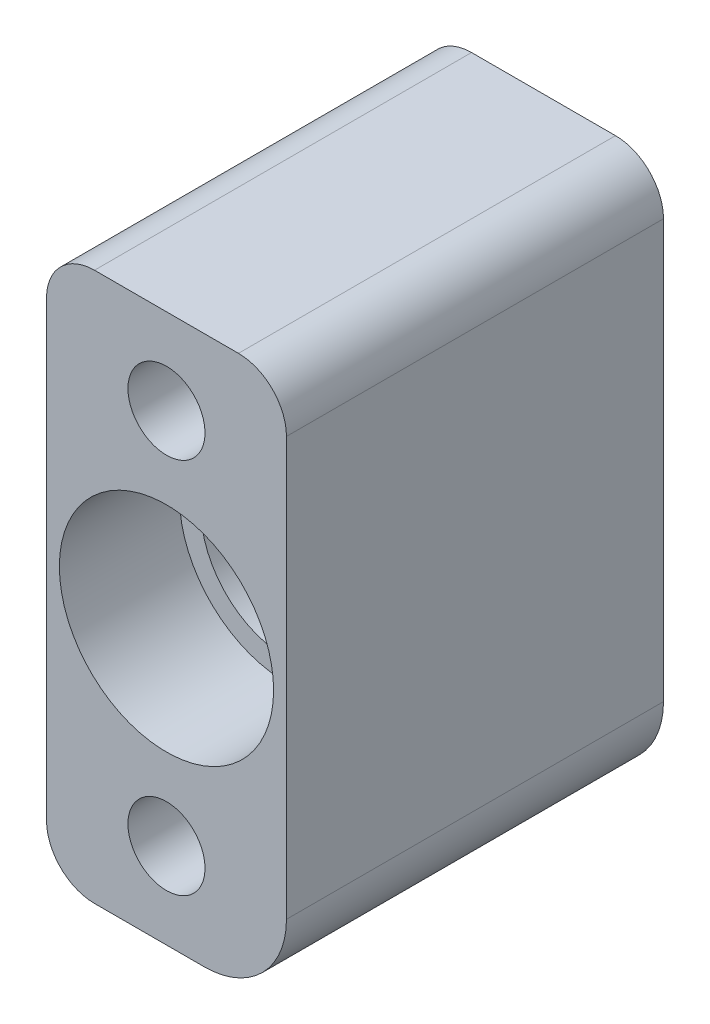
ISO-10303-21;
HEADER;
FILE_DESCRIPTION(('STEP AP214'),'2;1');
FILE_NAME('part.step','',(''),(''),'','','');
FILE_SCHEMA(('AUTOMOTIVE_DESIGN { 1 0 10303 214 1 1 1 1 }'));
ENDSEC;
DATA;
#1=APPLICATION_CONTEXT('core data for automotive mechanical design processes');
#2=APPLICATION_PROTOCOL_DEFINITION('international standard','automotive_design',2000,#1);
#3=PRODUCT_CONTEXT('',#1,'mechanical');
#4=PRODUCT('Part','Part','',(#3));
#5=PRODUCT_RELATED_PRODUCT_CATEGORY('part','',(#4));
#6=PRODUCT_DEFINITION_FORMATION('','',#4);
#7=PRODUCT_DEFINITION_CONTEXT('part definition',#1,'design');
#8=PRODUCT_DEFINITION('design','',#6,#7);
#9=PRODUCT_DEFINITION_SHAPE('','',#8);
#10=(LENGTH_UNIT() NAMED_UNIT(*) SI_UNIT(.MILLI.,.METRE.));
#11=(NAMED_UNIT(*) PLANE_ANGLE_UNIT() SI_UNIT($,.RADIAN.));
#12=(NAMED_UNIT(*) SI_UNIT($,.STERADIAN.) SOLID_ANGLE_UNIT());
#13=UNCERTAINTY_MEASURE_WITH_UNIT(LENGTH_MEASURE(1.E-05),#10,'distance_accuracy_value','');
#14=(GEOMETRIC_REPRESENTATION_CONTEXT(3) GLOBAL_UNCERTAINTY_ASSIGNED_CONTEXT((#13)) GLOBAL_UNIT_ASSIGNED_CONTEXT((#10,
#11,#12)) REPRESENTATION_CONTEXT('',''));
#15=CARTESIAN_POINT('',(0.,0.,0.));
#16=DIRECTION('',(0.,0.,1.));
#17=DIRECTION('',(1.,0.,0.));
#18=AXIS2_PLACEMENT_3D('',#15,#16,#17);
#19=CARTESIAN_POINT('',(-757.586295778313,-48.7304062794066,71.9582));
#20=DIRECTION('',(0.,0.,-1.));
#21=DIRECTION('',(-1.,0.,0.));
#22=AXIS2_PLACEMENT_3D('',#19,#20,#21);
#23=CYLINDRICAL_SURFACE('',#22,7.62000000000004);
#24=CARTESIAN_POINT('',(-757.586295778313,-48.7304062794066,37.0332));
#25=DIRECTION('',(0.,0.,-1.));
#26=DIRECTION('',(-1.,0.,0.));
#27=AXIS2_PLACEMENT_3D('',#24,#25,#26);
#28=CIRCLE('',#27,7.62000000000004);
#29=CARTESIAN_POINT('',(-749.966295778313,-48.7304062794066,37.0332));
#30=VERTEX_POINT('',#29);
#31=CARTESIAN_POINT('',(-757.586295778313,-56.3504062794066,37.0332));
#32=VERTEX_POINT('',#31);
#33=EDGE_CURVE('E101',#30,#32,#28,.T.);
#34=ORIENTED_EDGE('',*,*,#33,.F.);
#35=DIRECTION('',(0.,0.,-1.));
#36=VECTOR('',#35,1.);
#37=CARTESIAN_POINT('',(-749.966295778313,-48.7304062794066,71.9582));
#38=LINE('',#37,#36);
#39=CARTESIAN_POINT('',(-749.966295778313,-48.7304062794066,71.9582));
#40=VERTEX_POINT('',#39);
#41=EDGE_CURVE('E12',#40,#30,#38,.T.);
#42=ORIENTED_EDGE('',*,*,#41,.F.);
#43=CARTESIAN_POINT('',(-757.586295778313,-48.7304062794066,71.9582));
#44=DIRECTION('',(0.,0.,-1.));
#45=DIRECTION('',(-1.,0.,0.));
#46=AXIS2_PLACEMENT_3D('',#43,#44,#45);
#47=CIRCLE('',#46,7.62000000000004);
#48=CARTESIAN_POINT('',(-757.586295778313,-56.3504062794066,71.9582));
#49=VERTEX_POINT('',#48);
#50=EDGE_CURVE('E103',#40,#49,#47,.T.);
#51=ORIENTED_EDGE('',*,*,#50,.T.);
#52=DIRECTION('',(0.,0.,-1.));
#53=VECTOR('',#52,1.);
#54=CARTESIAN_POINT('',(-757.586295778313,-56.3504062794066,71.9582));
#55=LINE('',#54,#53);
#56=EDGE_CURVE('E99',#49,#32,#55,.T.);
#57=ORIENTED_EDGE('',*,*,#56,.T.);
#58=EDGE_LOOP('',(#34,#42,#51,#57));
#59=FACE_BOUND('',#58,.T.);
#60=ADVANCED_FACE('F48',(#59),#23,.T.);
#61=CARTESIAN_POINT('',(-749.966295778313,-9.99540627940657,71.9582));
#62=DIRECTION('',(1.,0.,0.));
#63=DIRECTION('',(0.,1.,0.));
#64=AXIS2_PLACEMENT_3D('',#61,#62,#63);
#65=PLANE('',#64);
#66=DIRECTION('',(0.,-1.,0.));
#67=VECTOR('',#66,1.);
#68=CARTESIAN_POINT('',(-749.966295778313,-48.7304062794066,37.0332));
#69=LINE('',#68,#67);
#70=CARTESIAN_POINT('',(-749.966295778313,-9.99540627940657,37.0332));
#71=VERTEX_POINT('',#70);
#72=EDGE_CURVE('E114',#71,#30,#69,.T.);
#73=ORIENTED_EDGE('',*,*,#72,.F.);
#74=DIRECTION('',(0.,0.,-1.));
#75=VECTOR('',#74,1.);
#76=CARTESIAN_POINT('',(-749.966295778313,-9.99540627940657,71.9582));
#77=LINE('',#76,#75);
#78=CARTESIAN_POINT('',(-749.966295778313,-9.99540627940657,71.9582));
#79=VERTEX_POINT('',#78);
#80=EDGE_CURVE('E58',#79,#71,#77,.T.);
#81=ORIENTED_EDGE('',*,*,#80,.F.);
#82=DIRECTION('',(0.,-1.,0.));
#83=VECTOR('',#82,1.);
#84=CARTESIAN_POINT('',(-749.966295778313,-9.99540627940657,71.9582));
#85=LINE('',#84,#83);
#86=EDGE_CURVE('E105',#79,#40,#85,.T.);
#87=ORIENTED_EDGE('',*,*,#86,.T.);
#88=ORIENTED_EDGE('',*,*,#41,.T.);
#89=EDGE_LOOP('',(#73,#81,#87,#88));
#90=FACE_BOUND('',#89,.T.);
#91=ADVANCED_FACE('F218',(#90),#65,.T.);
#92=CARTESIAN_POINT('',(-754.411295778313,-9.99540627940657,71.9582));
#93=DIRECTION('',(0.,0.,-1.));
#94=DIRECTION('',(-1.,0.,0.));
#95=AXIS2_PLACEMENT_3D('',#92,#93,#94);
#96=CYLINDRICAL_SURFACE('',#95,4.44500000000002);
#97=CARTESIAN_POINT('',(-754.411295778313,-9.99540627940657,37.0332));
#98=DIRECTION('',(0.,0.,-1.));
#99=DIRECTION('',(-1.,0.,0.));
#100=AXIS2_PLACEMENT_3D('',#97,#98,#99);
#101=CIRCLE('',#100,4.44500000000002);
#102=CARTESIAN_POINT('',(-754.411295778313,-5.55040627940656,37.0332));
#103=VERTEX_POINT('',#102);
#104=EDGE_CURVE('E125',#103,#71,#101,.T.);
#105=ORIENTED_EDGE('',*,*,#104,.F.);
#106=DIRECTION('',(0.,0.,-1.));
#107=VECTOR('',#106,1.);
#108=CARTESIAN_POINT('',(-754.411295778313,-5.55040627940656,71.9582));
#109=LINE('',#108,#107);
#110=CARTESIAN_POINT('',(-754.411295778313,-5.55040627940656,71.9582));
#111=VERTEX_POINT('',#110);
#112=EDGE_CURVE('E170',#111,#103,#109,.T.);
#113=ORIENTED_EDGE('',*,*,#112,.F.);
#114=CARTESIAN_POINT('',(-754.411295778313,-9.99540627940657,71.9582));
#115=DIRECTION('',(0.,0.,-1.));
#116=DIRECTION('',(-1.,0.,0.));
#117=AXIS2_PLACEMENT_3D('',#114,#115,#116);
#118=CIRCLE('',#117,4.44500000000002);
#119=EDGE_CURVE('E177',#111,#79,#118,.T.);
#120=ORIENTED_EDGE('',*,*,#119,.T.);
#121=ORIENTED_EDGE('',*,*,#80,.T.);
#122=EDGE_LOOP('',(#105,#113,#120,#121));
#123=FACE_BOUND('',#122,.T.);
#124=ADVANCED_FACE('F176',(#123),#96,.T.);
#125=CARTESIAN_POINT('',(-754.411295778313,-5.55040627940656,71.9582));
#126=DIRECTION('',(0.,1.,0.));
#127=DIRECTION('',(-1.,0.,0.));
#128=AXIS2_PLACEMENT_3D('',#125,#126,#127);
#129=PLANE('',#128);
#130=DIRECTION('',(1.,0.,0.));
#131=VECTOR('',#130,1.);
#132=CARTESIAN_POINT('',(-757.586295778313,-5.55040627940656,37.0332));
#133=LINE('',#132,#131);
#134=CARTESIAN_POINT('',(-767.746295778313,-5.55040627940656,37.0332));
#135=VERTEX_POINT('',#134);
#136=EDGE_CURVE('E127',#135,#103,#133,.T.);
#137=ORIENTED_EDGE('',*,*,#136,.F.);
#138=DIRECTION('',(0.,0.,-1.));
#139=VECTOR('',#138,1.);
#140=CARTESIAN_POINT('',(-767.746295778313,-5.55040627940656,71.9582));
#141=LINE('',#140,#139);
#142=CARTESIAN_POINT('',(-767.746295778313,-5.55040627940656,71.9582));
#143=VERTEX_POINT('',#142);
#144=EDGE_CURVE('E158',#143,#135,#141,.T.);
#145=ORIENTED_EDGE('',*,*,#144,.F.);
#146=DIRECTION('',(1.,0.,0.));
#147=VECTOR('',#146,1.);
#148=CARTESIAN_POINT('',(-754.411295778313,-5.55040627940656,71.9582));
#149=LINE('',#148,#147);
#150=EDGE_CURVE('E171',#143,#111,#149,.T.);
#151=ORIENTED_EDGE('',*,*,#150,.T.);
#152=ORIENTED_EDGE('',*,*,#112,.T.);
#153=EDGE_LOOP('',(#137,#145,#151,#152));
#154=FACE_BOUND('',#153,.T.);
#155=ADVANCED_FACE('F165',(#154),#129,.T.);
#156=CARTESIAN_POINT('',(-767.746295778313,-9.99540627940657,71.9582));
#157=DIRECTION('',(0.,0.,-1.));
#158=DIRECTION('',(-1.,0.,0.));
#159=AXIS2_PLACEMENT_3D('',#156,#157,#158);
#160=CYLINDRICAL_SURFACE('',#159,4.44500000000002);
#161=CARTESIAN_POINT('',(-767.746295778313,-9.99540627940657,37.0332));
#162=DIRECTION('',(0.,0.,-1.));
#163=DIRECTION('',(-1.,0.,0.));
#164=AXIS2_PLACEMENT_3D('',#161,#162,#163);
#165=CIRCLE('',#164,4.44500000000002);
#166=CARTESIAN_POINT('',(-772.191295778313,-9.99540627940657,37.0332));
#167=VERTEX_POINT('',#166);
#168=EDGE_CURVE('E130',#167,#135,#165,.T.);
#169=ORIENTED_EDGE('',*,*,#168,.F.);
#170=DIRECTION('',(0.,0.,-1.));
#171=VECTOR('',#170,1.);
#172=CARTESIAN_POINT('',(-772.191295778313,-9.99540627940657,71.9582));
#173=LINE('',#172,#171);
#174=CARTESIAN_POINT('',(-772.191295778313,-9.99540627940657,71.9582));
#175=VERTEX_POINT('',#174);
#176=EDGE_CURVE('E148',#175,#167,#173,.T.);
#177=ORIENTED_EDGE('',*,*,#176,.F.);
#178=CARTESIAN_POINT('',(-767.746295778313,-9.99540627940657,71.9582));
#179=DIRECTION('',(0.,0.,-1.));
#180=DIRECTION('',(1.,0.,0.));
#181=AXIS2_PLACEMENT_3D('',#178,#179,#180);
#182=CIRCLE('',#181,4.44500000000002);
#183=EDGE_CURVE('E215',#175,#143,#182,.T.);
#184=ORIENTED_EDGE('',*,*,#183,.T.);
#185=ORIENTED_EDGE('',*,*,#144,.T.);
#186=EDGE_LOOP('',(#169,#177,#184,#185));
#187=FACE_BOUND('',#186,.T.);
#188=ADVANCED_FACE('F160',(#187),#160,.T.);
#189=CARTESIAN_POINT('',(-772.191295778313,-9.99540627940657,71.9582));
#190=DIRECTION('',(-1.,0.,0.));
#191=DIRECTION('',(0.,0.,1.));
#192=AXIS2_PLACEMENT_3D('',#189,#190,#191);
#193=PLANE('',#192);
#194=DIRECTION('',(0.,1.,0.));
#195=VECTOR('',#194,1.);
#196=CARTESIAN_POINT('',(-772.191295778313,-48.7304062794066,37.0332));
#197=LINE('',#196,#195);
#198=CARTESIAN_POINT('',(-772.191295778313,-51.9054062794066,37.0332));
#199=VERTEX_POINT('',#198);
#200=EDGE_CURVE('E133',#199,#167,#197,.T.);
#201=ORIENTED_EDGE('',*,*,#200,.F.);
#202=DIRECTION('',(0.,0.,-1.));
#203=VECTOR('',#202,1.);
#204=CARTESIAN_POINT('',(-772.191295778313,-51.9054062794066,71.9582));
#205=LINE('',#204,#203);
#206=CARTESIAN_POINT('',(-772.191295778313,-51.9054062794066,71.9582));
#207=VERTEX_POINT('',#206);
#208=EDGE_CURVE('E142',#207,#199,#205,.T.);
#209=ORIENTED_EDGE('',*,*,#208,.F.);
#210=DIRECTION('',(0.,1.,0.));
#211=VECTOR('',#210,1.);
#212=CARTESIAN_POINT('',(-772.191295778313,-9.99540627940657,71.9582));
#213=LINE('',#212,#211);
#214=EDGE_CURVE('E154',#207,#175,#213,.T.);
#215=ORIENTED_EDGE('',*,*,#214,.T.);
#216=ORIENTED_EDGE('',*,*,#176,.T.);
#217=EDGE_LOOP('',(#201,#209,#215,#216));
#218=FACE_BOUND('',#217,.T.);
#219=ADVANCED_FACE('F150',(#218),#193,.T.);
#220=CARTESIAN_POINT('',(-767.746295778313,-51.9054062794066,71.9582));
#221=DIRECTION('',(0.,0.,-1.));
#222=DIRECTION('',(-1.,0.,0.));
#223=AXIS2_PLACEMENT_3D('',#220,#221,#222);
#224=CYLINDRICAL_SURFACE('',#223,4.44500000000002);
#225=CARTESIAN_POINT('',(-767.746295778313,-51.9054062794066,37.0332));
#226=DIRECTION('',(0.,0.,-1.));
#227=DIRECTION('',(-1.,0.,0.));
#228=AXIS2_PLACEMENT_3D('',#225,#226,#227);
#229=CIRCLE('',#228,4.44500000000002);
#230=CARTESIAN_POINT('',(-767.746295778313,-56.3504062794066,37.0332));
#231=VERTEX_POINT('',#230);
#232=EDGE_CURVE('E111',#231,#199,#229,.T.);
#233=ORIENTED_EDGE('',*,*,#232,.F.);
#234=DIRECTION('',(0.,0.,-1.));
#235=VECTOR('',#234,1.);
#236=CARTESIAN_POINT('',(-767.746295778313,-56.3504062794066,71.9582));
#237=LINE('',#236,#235);
#238=CARTESIAN_POINT('',(-767.746295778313,-56.3504062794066,71.9582));
#239=VERTEX_POINT('',#238);
#240=EDGE_CURVE('E95',#239,#231,#237,.T.);
#241=ORIENTED_EDGE('',*,*,#240,.F.);
#242=CARTESIAN_POINT('',(-767.746295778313,-51.9054062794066,71.9582));
#243=DIRECTION('',(0.,0.,-1.));
#244=DIRECTION('',(-1.,0.,0.));
#245=AXIS2_PLACEMENT_3D('',#242,#243,#244);
#246=CIRCLE('',#245,4.44500000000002);
#247=EDGE_CURVE('E144',#239,#207,#246,.T.);
#248=ORIENTED_EDGE('',*,*,#247,.T.);
#249=ORIENTED_EDGE('',*,*,#208,.T.);
#250=EDGE_LOOP('',(#233,#241,#248,#249));
#251=FACE_BOUND('',#250,.T.);
#252=ADVANCED_FACE('F137',(#251),#224,.T.);
#253=CARTESIAN_POINT('',(-757.586295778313,-56.3504062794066,71.9582));
#254=DIRECTION('',(0.,-1.,0.));
#255=DIRECTION('',(1.,0.,0.));
#256=AXIS2_PLACEMENT_3D('',#253,#254,#255);
#257=PLANE('',#256);
#258=DIRECTION('',(-1.,0.,0.));
#259=VECTOR('',#258,1.);
#260=CARTESIAN_POINT('',(-757.586295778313,-56.3504062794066,37.0332));
#261=LINE('',#260,#259);
#262=EDGE_CURVE('E52',#32,#231,#261,.T.);
#263=ORIENTED_EDGE('',*,*,#262,.F.);
#264=ORIENTED_EDGE('',*,*,#56,.F.);
#265=DIRECTION('',(-1.,0.,0.));
#266=VECTOR('',#265,1.);
#267=CARTESIAN_POINT('',(-757.586295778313,-56.3504062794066,71.9582));
#268=LINE('',#267,#266);
#269=EDGE_CURVE('E211',#49,#239,#268,.T.);
#270=ORIENTED_EDGE('',*,*,#269,.T.);
#271=ORIENTED_EDGE('',*,*,#240,.T.);
#272=EDGE_LOOP('',(#263,#264,#270,#271));
#273=FACE_BOUND('',#272,.T.);
#274=ADVANCED_FACE('F108',(#273),#257,.T.);
#275=CARTESIAN_POINT('',(-757.586295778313,-48.7304062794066,71.9582));
#276=DIRECTION('',(0.,0.,-1.));
#277=DIRECTION('',(-1.,0.,0.));
#278=AXIS2_PLACEMENT_3D('',#275,#276,#277);
#279=PLANE('',#278);
#280=CARTESIAN_POINT('',(-761.078795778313,-13.4879062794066,71.9582));
#281=DIRECTION('',(0.,0.,-1.));
#282=DIRECTION('',(-1.,0.,0.));
#283=AXIS2_PLACEMENT_3D('',#280,#281,#282);
#284=CIRCLE('',#283,3.56869999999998);
#285=CARTESIAN_POINT('',(-764.647495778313,-13.4879062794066,71.9582));
#286=VERTEX_POINT('',#285);
#287=EDGE_CURVE('E382',#286,#286,#284,.T.);
#288=ORIENTED_EDGE('',*,*,#287,.T.);
#289=EDGE_LOOP('',(#288));
#290=FACE_BOUND('',#289,.T.);
#291=CARTESIAN_POINT('',(-761.078795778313,-48.4129062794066,71.9582));
#292=DIRECTION('',(0.,0.,-1.));
#293=DIRECTION('',(-1.,0.,0.));
#294=AXIS2_PLACEMENT_3D('',#291,#292,#293);
#295=CIRCLE('',#294,3.56869999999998);
#296=CARTESIAN_POINT('',(-764.647495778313,-48.4129062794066,71.9582));
#297=VERTEX_POINT('',#296);
#298=EDGE_CURVE('E188',#297,#297,#295,.T.);
#299=ORIENTED_EDGE('',*,*,#298,.T.);
#300=EDGE_LOOP('',(#299));
#301=FACE_BOUND('',#300,.T.);
#302=CARTESIAN_POINT('',(-761.078795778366,-30.9504062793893,71.9582));
#303=DIRECTION('',(0.,0.,1.));
#304=DIRECTION('',(1.,0.,0.));
#305=AXIS2_PLACEMENT_3D('',#302,#303,#304);
#306=CIRCLE('',#305,9.92187499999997);
#307=CARTESIAN_POINT('',(-751.156920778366,-30.9504062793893,71.9582));
#308=VERTEX_POINT('',#307);
#309=EDGE_CURVE('E115',#308,#308,#306,.T.);
#310=ORIENTED_EDGE('',*,*,#309,.F.);
#311=EDGE_LOOP('',(#310));
#312=FACE_BOUND('',#311,.T.);
#313=ORIENTED_EDGE('',*,*,#50,.F.);
#314=ORIENTED_EDGE('',*,*,#86,.F.);
#315=ORIENTED_EDGE('',*,*,#119,.F.);
#316=ORIENTED_EDGE('',*,*,#150,.F.);
#317=ORIENTED_EDGE('',*,*,#183,.F.);
#318=ORIENTED_EDGE('',*,*,#214,.F.);
#319=ORIENTED_EDGE('',*,*,#247,.F.);
#320=ORIENTED_EDGE('',*,*,#269,.F.);
#321=EDGE_LOOP('',(#313,#314,#315,#316,#317,#318,#319,#320));
#322=FACE_BOUND('',#321,.T.);
#323=ADVANCED_FACE('F220',(#290,#301,#312,#322),#279,.F.);
#324=CARTESIAN_POINT('',(-757.586295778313,-48.7304062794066,37.0332));
#325=DIRECTION('',(0.,0.,-1.));
#326=DIRECTION('',(-1.,0.,0.));
#327=AXIS2_PLACEMENT_3D('',#324,#325,#326);
#328=PLANE('',#327);
#329=CARTESIAN_POINT('',(-761.078795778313,-13.4879062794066,37.0332));
#330=DIRECTION('',(0.,0.,-1.));
#331=DIRECTION('',(-1.,0.,0.));
#332=AXIS2_PLACEMENT_3D('',#329,#330,#331);
#333=CIRCLE('',#332,5.35940000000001);
#334=CARTESIAN_POINT('',(-766.438195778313,-13.4879062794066,37.0332));
#335=VERTEX_POINT('',#334);
#336=EDGE_CURVE('E186',#335,#335,#333,.T.);
#337=ORIENTED_EDGE('',*,*,#336,.F.);
#338=EDGE_LOOP('',(#337));
#339=FACE_BOUND('',#338,.T.);
#340=CARTESIAN_POINT('',(-761.078795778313,-48.4129062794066,37.0332));
#341=DIRECTION('',(0.,0.,-1.));
#342=DIRECTION('',(-1.,0.,0.));
#343=AXIS2_PLACEMENT_3D('',#340,#341,#342);
#344=CIRCLE('',#343,5.35940000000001);
#345=CARTESIAN_POINT('',(-766.438195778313,-48.4129062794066,37.0332));
#346=VERTEX_POINT('',#345);
#347=EDGE_CURVE('E190',#346,#346,#344,.T.);
#348=ORIENTED_EDGE('',*,*,#347,.F.);
#349=EDGE_LOOP('',(#348));
#350=FACE_BOUND('',#349,.T.);
#351=CARTESIAN_POINT('',(-761.078795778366,-30.9504062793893,37.0332));
#352=DIRECTION('',(0.,0.,-1.));
#353=DIRECTION('',(-1.,0.,0.));
#354=AXIS2_PLACEMENT_3D('',#351,#352,#353);
#355=CIRCLE('',#354,7.93750000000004);
#356=CARTESIAN_POINT('',(-769.016295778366,-30.9504062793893,37.0332));
#357=VERTEX_POINT('',#356);
#358=EDGE_CURVE('E122',#357,#357,#355,.F.);
#359=ORIENTED_EDGE('',*,*,#358,.T.);
#360=EDGE_LOOP('',(#359));
#361=FACE_BOUND('',#360,.T.);
#362=ORIENTED_EDGE('',*,*,#33,.T.);
#363=ORIENTED_EDGE('',*,*,#262,.T.);
#364=ORIENTED_EDGE('',*,*,#232,.T.);
#365=ORIENTED_EDGE('',*,*,#200,.T.);
#366=ORIENTED_EDGE('',*,*,#168,.T.);
#367=ORIENTED_EDGE('',*,*,#136,.T.);
#368=ORIENTED_EDGE('',*,*,#104,.T.);
#369=ORIENTED_EDGE('',*,*,#72,.T.);
#370=EDGE_LOOP('',(#362,#363,#364,#365,#366,#367,#368,#369));
#371=FACE_BOUND('',#370,.T.);
#372=ADVANCED_FACE('F50',(#339,#350,#361,#371),#328,.T.);
#373=CARTESIAN_POINT('',(-761.078795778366,-30.9504062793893,71.9582));
#374=DIRECTION('',(0.,0.,1.));
#375=DIRECTION('',(1.,0.,0.));
#376=AXIS2_PLACEMENT_3D('',#373,#374,#375);
#377=CYLINDRICAL_SURFACE('',#376,9.92187499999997);
#378=CARTESIAN_POINT('',(-761.078795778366,-30.9504062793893,60.833));
#379=DIRECTION('',(0.,0.,1.));
#380=DIRECTION('',(1.,0.,0.));
#381=AXIS2_PLACEMENT_3D('',#378,#379,#380);
#382=CIRCLE('',#381,9.92187499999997);
#383=CARTESIAN_POINT('',(-751.156920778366,-30.9504062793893,60.833));
#384=VERTEX_POINT('',#383);
#385=EDGE_CURVE('E118',#384,#384,#382,.T.);
#386=ORIENTED_EDGE('',*,*,#385,.F.);
#387=EDGE_LOOP('',(#386));
#388=FACE_BOUND('',#387,.T.);
#389=ORIENTED_EDGE('',*,*,#309,.T.);
#390=EDGE_LOOP('',(#389));
#391=FACE_BOUND('',#390,.T.);
#392=ADVANCED_FACE('F234',(#388,#391),#377,.F.);
#393=CARTESIAN_POINT('',(-753.141295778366,-30.9504062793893,60.833));
#394=DIRECTION('',(0.,0.,-1.));
#395=DIRECTION('',(-1.,0.,0.));
#396=AXIS2_PLACEMENT_3D('',#393,#394,#395);
#397=PLANE('',#396);
#398=CARTESIAN_POINT('',(-761.078795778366,-30.9504062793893,60.833));
#399=DIRECTION('',(0.,0.,1.));
#400=DIRECTION('',(1.,0.,0.));
#401=AXIS2_PLACEMENT_3D('',#398,#399,#400);
#402=CIRCLE('',#401,7.93750000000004);
#403=CARTESIAN_POINT('',(-753.141295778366,-30.9504062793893,60.833));
#404=VERTEX_POINT('',#403);
#405=EDGE_CURVE('E196',#404,#404,#402,.T.);
#406=ORIENTED_EDGE('',*,*,#405,.F.);
#407=EDGE_LOOP('',(#406));
#408=FACE_BOUND('',#407,.T.);
#409=ORIENTED_EDGE('',*,*,#385,.T.);
#410=EDGE_LOOP('',(#409));
#411=FACE_BOUND('',#410,.T.);
#412=ADVANCED_FACE('F293',(#408,#411),#397,.F.);
#413=CARTESIAN_POINT('',(-761.078795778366,-30.9504062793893,71.9582));
#414=DIRECTION('',(0.,0.,1.));
#415=DIRECTION('',(1.,0.,0.));
#416=AXIS2_PLACEMENT_3D('',#413,#414,#415);
#417=CYLINDRICAL_SURFACE('',#416,7.93750000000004);
#418=ORIENTED_EDGE('',*,*,#358,.F.);
#419=EDGE_LOOP('',(#418));
#420=FACE_BOUND('',#419,.T.);
#421=ORIENTED_EDGE('',*,*,#405,.T.);
#422=EDGE_LOOP('',(#421));
#423=FACE_BOUND('',#422,.T.);
#424=ADVANCED_FACE('F301',(#420,#423),#417,.F.);
#425=CARTESIAN_POINT('',(-761.078795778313,-48.4129062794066,40.2082));
#426=DIRECTION('',(0.,0.,-1.));
#427=DIRECTION('',(-1.,0.,0.));
#428=AXIS2_PLACEMENT_3D('',#425,#426,#427);
#429=CYLINDRICAL_SURFACE('',#428,5.35940000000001);
#430=CARTESIAN_POINT('',(-761.078795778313,-48.4129062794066,49.8602));
#431=DIRECTION('',(0.,0.,-1.));
#432=DIRECTION('',(-1.,0.,0.));
#433=AXIS2_PLACEMENT_3D('',#430,#431,#432);
#434=CIRCLE('',#433,5.35940000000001);
#435=CARTESIAN_POINT('',(-766.438195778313,-48.4129062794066,49.8602));
#436=VERTEX_POINT('',#435);
#437=EDGE_CURVE('E192',#436,#436,#434,.T.);
#438=ORIENTED_EDGE('',*,*,#437,.F.);
#439=EDGE_LOOP('',(#438));
#440=FACE_BOUND('',#439,.T.);
#441=ORIENTED_EDGE('',*,*,#347,.T.);
#442=EDGE_LOOP('',(#441));
#443=FACE_BOUND('',#442,.T.);
#444=ADVANCED_FACE('F310',(#440,#443),#429,.F.);
#445=CARTESIAN_POINT('',(-757.510095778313,-48.4129062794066,49.8602));
#446=DIRECTION('',(0.,0.,1.));
#447=DIRECTION('',(1.,0.,0.));
#448=AXIS2_PLACEMENT_3D('',#445,#446,#447);
#449=PLANE('',#448);
#450=CARTESIAN_POINT('',(-761.078795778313,-48.4129062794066,49.8602));
#451=DIRECTION('',(0.,0.,-1.));
#452=DIRECTION('',(-1.,0.,0.));
#453=AXIS2_PLACEMENT_3D('',#450,#451,#452);
#454=CIRCLE('',#453,3.56869999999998);
#455=CARTESIAN_POINT('',(-764.647495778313,-48.4129062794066,49.8602));
#456=VERTEX_POINT('',#455);
#457=EDGE_CURVE('E198',#456,#456,#454,.T.);
#458=ORIENTED_EDGE('',*,*,#457,.F.);
#459=EDGE_LOOP('',(#458));
#460=FACE_BOUND('',#459,.T.);
#461=ORIENTED_EDGE('',*,*,#437,.T.);
#462=EDGE_LOOP('',(#461));
#463=FACE_BOUND('',#462,.T.);
#464=ADVANCED_FACE('F320',(#460,#463),#449,.F.);
#465=CARTESIAN_POINT('',(-761.078795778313,-48.4129062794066,40.2082));
#466=DIRECTION('',(0.,0.,-1.));
#467=DIRECTION('',(-1.,0.,0.));
#468=AXIS2_PLACEMENT_3D('',#465,#466,#467);
#469=CYLINDRICAL_SURFACE('',#468,3.56869999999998);
#470=ORIENTED_EDGE('',*,*,#298,.F.);
#471=EDGE_LOOP('',(#470));
#472=FACE_BOUND('',#471,.T.);
#473=ORIENTED_EDGE('',*,*,#457,.T.);
#474=EDGE_LOOP('',(#473));
#475=FACE_BOUND('',#474,.T.);
#476=ADVANCED_FACE('F329',(#472,#475),#469,.F.);
#477=CARTESIAN_POINT('',(-761.078795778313,-13.4879062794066,40.2082));
#478=DIRECTION('',(0.,0.,-1.));
#479=DIRECTION('',(-1.,0.,0.));
#480=AXIS2_PLACEMENT_3D('',#477,#478,#479);
#481=CYLINDRICAL_SURFACE('',#480,5.35940000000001);
#482=CARTESIAN_POINT('',(-761.078795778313,-13.4879062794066,49.8602));
#483=DIRECTION('',(0.,0.,-1.));
#484=DIRECTION('',(-1.,0.,0.));
#485=AXIS2_PLACEMENT_3D('',#482,#483,#484);
#486=CIRCLE('',#485,5.35940000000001);
#487=CARTESIAN_POINT('',(-766.438195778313,-13.4879062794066,49.8602));
#488=VERTEX_POINT('',#487);
#489=EDGE_CURVE('E189',#488,#488,#486,.T.);
#490=ORIENTED_EDGE('',*,*,#489,.F.);
#491=EDGE_LOOP('',(#490));
#492=FACE_BOUND('',#491,.T.);
#493=ORIENTED_EDGE('',*,*,#336,.T.);
#494=EDGE_LOOP('',(#493));
#495=FACE_BOUND('',#494,.T.);
#496=ADVANCED_FACE('F338',(#492,#495),#481,.F.);
#497=CARTESIAN_POINT('',(-757.510095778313,-13.4879062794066,49.8602));
#498=DIRECTION('',(0.,0.,1.));
#499=DIRECTION('',(1.,0.,0.));
#500=AXIS2_PLACEMENT_3D('',#497,#498,#499);
#501=PLANE('',#500);
#502=CARTESIAN_POINT('',(-761.078795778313,-13.4879062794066,49.8602));
#503=DIRECTION('',(0.,0.,-1.));
#504=DIRECTION('',(-1.,0.,0.));
#505=AXIS2_PLACEMENT_3D('',#502,#503,#504);
#506=CIRCLE('',#505,3.56869999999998);
#507=CARTESIAN_POINT('',(-764.647495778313,-13.4879062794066,49.8602));
#508=VERTEX_POINT('',#507);
#509=EDGE_CURVE('E385',#508,#508,#506,.T.);
#510=ORIENTED_EDGE('',*,*,#509,.F.);
#511=EDGE_LOOP('',(#510));
#512=FACE_BOUND('',#511,.T.);
#513=ORIENTED_EDGE('',*,*,#489,.T.);
#514=EDGE_LOOP('',(#513));
#515=FACE_BOUND('',#514,.T.);
#516=ADVANCED_FACE('F347',(#512,#515),#501,.F.);
#517=CARTESIAN_POINT('',(-761.078795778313,-13.4879062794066,40.2082));
#518=DIRECTION('',(0.,0.,-1.));
#519=DIRECTION('',(-1.,0.,0.));
#520=AXIS2_PLACEMENT_3D('',#517,#518,#519);
#521=CYLINDRICAL_SURFACE('',#520,3.56869999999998);
#522=ORIENTED_EDGE('',*,*,#287,.F.);
#523=EDGE_LOOP('',(#522));
#524=FACE_BOUND('',#523,.T.);
#525=ORIENTED_EDGE('',*,*,#509,.T.);
#526=EDGE_LOOP('',(#525));
#527=FACE_BOUND('',#526,.T.);
#528=ADVANCED_FACE('F356',(#524,#527),#521,.F.);
#529=CLOSED_SHELL('',(#60,#91,#124,#155,#188,#219,#252,#274,#323,#372,#392,#412,#424,#444,#464,
#476,#496,#516,#528));
#530=MANIFOLD_SOLID_BREP('B2',#529);
#531=ADVANCED_BREP_SHAPE_REPRESENTATION('',(#18,#530),#14);
#532=SHAPE_DEFINITION_REPRESENTATION(#9,#531);
ENDSEC;
END-ISO-10303-21;
